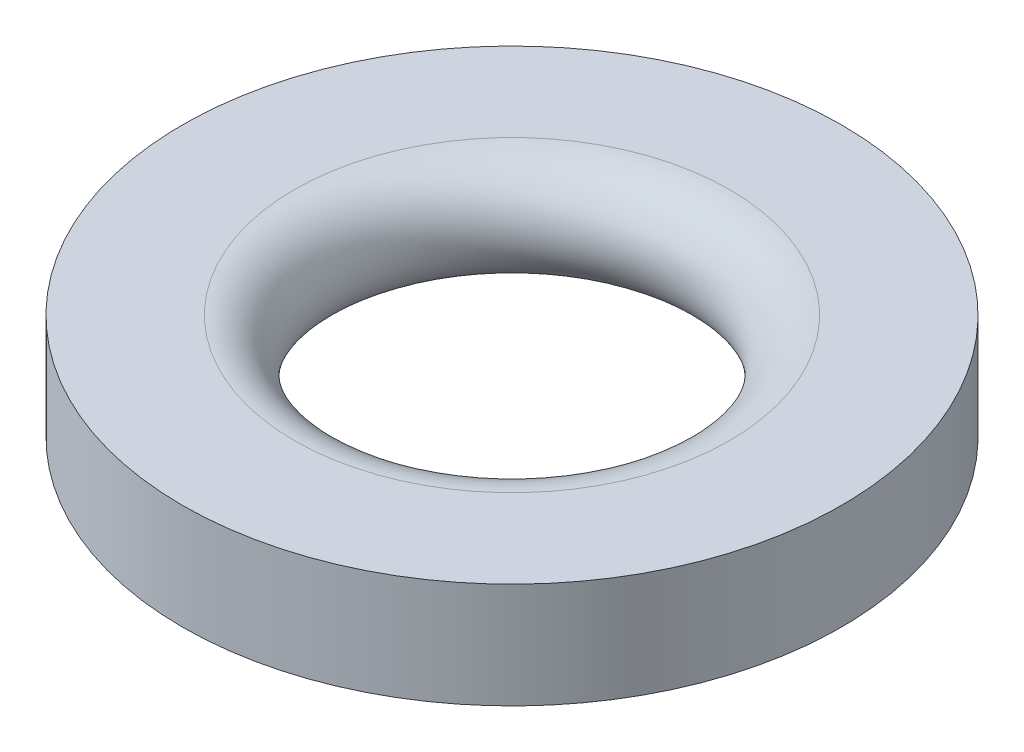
ISO-10303-21;
HEADER;
FILE_DESCRIPTION(('STEP AP214'),'2;1');
FILE_NAME('part.step','',(''),(''),'','','');
FILE_SCHEMA(('AUTOMOTIVE_DESIGN { 1 0 10303 214 1 1 1 1 }'));
ENDSEC;
DATA;
#1=APPLICATION_CONTEXT('core data for automotive mechanical design processes');
#2=APPLICATION_PROTOCOL_DEFINITION('international standard','automotive_design',2000,#1);
#3=PRODUCT_CONTEXT('',#1,'mechanical');
#4=PRODUCT('Part','Part','',(#3));
#5=PRODUCT_RELATED_PRODUCT_CATEGORY('part','',(#4));
#6=PRODUCT_DEFINITION_FORMATION('','',#4);
#7=PRODUCT_DEFINITION_CONTEXT('part definition',#1,'design');
#8=PRODUCT_DEFINITION('design','',#6,#7);
#9=PRODUCT_DEFINITION_SHAPE('','',#8);
#10=(LENGTH_UNIT() NAMED_UNIT(*) SI_UNIT(.MILLI.,.METRE.));
#11=(NAMED_UNIT(*) PLANE_ANGLE_UNIT() SI_UNIT($,.RADIAN.));
#12=(NAMED_UNIT(*) SI_UNIT($,.STERADIAN.) SOLID_ANGLE_UNIT());
#13=UNCERTAINTY_MEASURE_WITH_UNIT(LENGTH_MEASURE(1.E-05),#10,'distance_accuracy_value','');
#14=(GEOMETRIC_REPRESENTATION_CONTEXT(3) GLOBAL_UNCERTAINTY_ASSIGNED_CONTEXT((#13)) GLOBAL_UNIT_ASSIGNED_CONTEXT((#10,
#11,#12)) REPRESENTATION_CONTEXT('',''));
#15=CARTESIAN_POINT('',(0.,0.,0.));
#16=DIRECTION('',(0.,0.,1.));
#17=DIRECTION('',(1.,0.,0.));
#18=AXIS2_PLACEMENT_3D('',#15,#16,#17);
#19=CARTESIAN_POINT('',(0.,0.,0.));
#20=DIRECTION('',(0.,1.,0.));
#21=DIRECTION('',(0.,0.,1.));
#22=AXIS2_PLACEMENT_3D('',#19,#20,#21);
#23=TOROIDAL_SURFACE('',#22,2.0955,0.508);
#24=CARTESIAN_POINT('',(8.88178419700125E-13,-0.507999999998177,8.88178419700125E-13));
#25=DIRECTION('',(0.,1.,0.));
#26=DIRECTION('',(0.,0.,1.));
#27=AXIS2_PLACEMENT_3D('',#24,#25,#26);
#28=CIRCLE('',#27,2.0955);
#29=CARTESIAN_POINT('',(8.87771287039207E-13,-0.507999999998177,2.0955000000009));
#30=VERTEX_POINT('',#29);
#31=EDGE_CURVE('E44',#30,#30,#28,.T.);
#32=ORIENTED_EDGE('',*,*,#31,.F.);
#33=EDGE_LOOP('',(#32));
#34=FACE_BOUND('',#33,.T.);
#35=CARTESIAN_POINT('',(1.77635683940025E-12,0.507999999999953,1.33226762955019E-12));
#36=DIRECTION('',(0.,1.,0.));
#37=DIRECTION('',(0.,0.,1.));
#38=AXIS2_PLACEMENT_3D('',#35,#36,#37);
#39=CIRCLE('',#38,2.0955);
#40=CARTESIAN_POINT('',(1.77594970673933E-12,0.507999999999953,2.09550000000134));
#41=VERTEX_POINT('',#40);
#42=EDGE_CURVE('E10',#41,#41,#39,.T.);
#43=ORIENTED_EDGE('',*,*,#42,.T.);
#44=EDGE_LOOP('',(#43));
#45=FACE_BOUND('',#44,.T.);
#46=ADVANCED_FACE('F30',(#34,#45),#23,.T.);
#47=CARTESIAN_POINT('',(8.88178419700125E-13,0.508000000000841,-2.09549999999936));
#48=DIRECTION('',(0.,-1.,0.));
#49=DIRECTION('',(0.,0.,-1.));
#50=AXIS2_PLACEMENT_3D('',#47,#48,#49);
#51=PLANE('',#50);
#52=ORIENTED_EDGE('',*,*,#42,.F.);
#53=EDGE_LOOP('',(#52));
#54=FACE_BOUND('',#53,.T.);
#55=CARTESIAN_POINT('',(1.77635683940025E-12,0.507999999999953,1.33226762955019E-12));
#56=DIRECTION('',(0.,1.,0.));
#57=DIRECTION('',(0.,0.,1.));
#58=AXIS2_PLACEMENT_3D('',#55,#56,#57);
#59=CIRCLE('',#58,3.175);
#60=CARTESIAN_POINT('',(1.77573997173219E-12,0.507999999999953,3.17500000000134));
#61=VERTEX_POINT('',#60);
#62=EDGE_CURVE('E36',#61,#61,#59,.T.);
#63=ORIENTED_EDGE('',*,*,#62,.T.);
#64=EDGE_LOOP('',(#63));
#65=FACE_BOUND('',#64,.T.);
#66=ADVANCED_FACE('F53',(#54,#65),#51,.F.);
#67=CARTESIAN_POINT('',(-2.66453525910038E-12,33.2909034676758,1.33226762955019E-12));
#68=DIRECTION('',(0.,1.,0.));
#69=DIRECTION('',(0.,0.,1.));
#70=AXIS2_PLACEMENT_3D('',#67,#68,#69);
#71=CYLINDRICAL_SURFACE('',#70,3.175);
#72=ORIENTED_EDGE('',*,*,#62,.F.);
#73=EDGE_LOOP('',(#72));
#74=FACE_BOUND('',#73,.T.);
#75=CARTESIAN_POINT('',(8.88178419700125E-13,-0.507999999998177,8.88178419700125E-13));
#76=DIRECTION('',(0.,1.,0.));
#77=DIRECTION('',(0.,0.,1.));
#78=AXIS2_PLACEMENT_3D('',#75,#76,#77);
#79=CIRCLE('',#78,3.175);
#80=CARTESIAN_POINT('',(8.87561552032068E-13,-0.507999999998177,3.1750000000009));
#81=VERTEX_POINT('',#80);
#82=EDGE_CURVE('E40',#81,#81,#79,.T.);
#83=ORIENTED_EDGE('',*,*,#82,.T.);
#84=EDGE_LOOP('',(#83));
#85=FACE_BOUND('',#84,.T.);
#86=ADVANCED_FACE('F57',(#74,#85),#71,.T.);
#87=CARTESIAN_POINT('',(-8.88178419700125E-13,-0.507999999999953,-3.17499999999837));
#88=DIRECTION('',(0.,1.,0.));
#89=DIRECTION('',(0.,0.,1.));
#90=AXIS2_PLACEMENT_3D('',#87,#88,#89);
#91=PLANE('',#90);
#92=ORIENTED_EDGE('',*,*,#82,.F.);
#93=EDGE_LOOP('',(#92));
#94=FACE_BOUND('',#93,.T.);
#95=ORIENTED_EDGE('',*,*,#31,.T.);
#96=EDGE_LOOP('',(#95));
#97=FACE_BOUND('',#96,.T.);
#98=ADVANCED_FACE('F50',(#94,#97),#91,.F.);
#99=CLOSED_SHELL('',(#46,#66,#86,#98));
#100=MANIFOLD_SOLID_BREP('B2',#99);
#101=ADVANCED_BREP_SHAPE_REPRESENTATION('',(#18,#100),#14);
#102=SHAPE_DEFINITION_REPRESENTATION(#9,#101);
ENDSEC;
END-ISO-10303-21;
